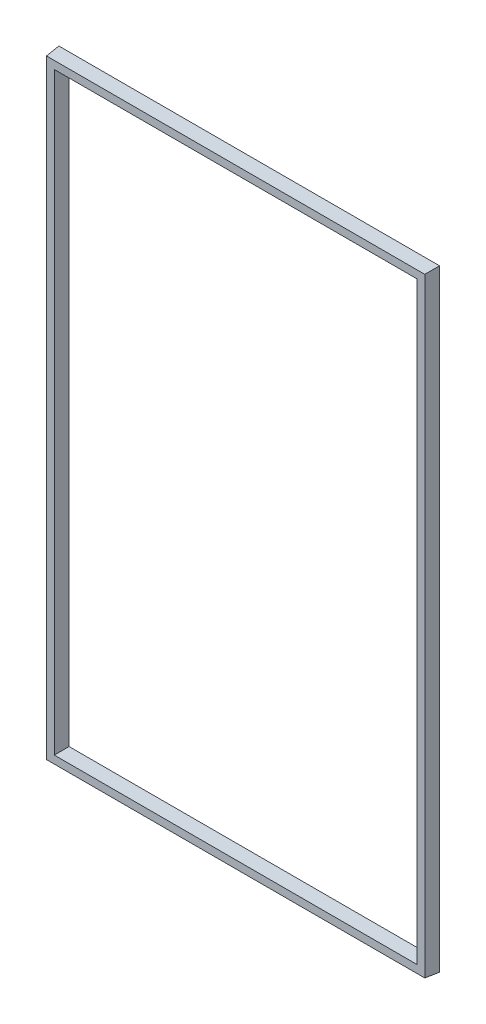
from build123d import *

# Parameters (mm, degrees)
SKETCH1_W           = 53
SKETCH1_H           = 87
BOSS_EXTRUDE1_DEPTH = 2
BOSS_EXTRUDE1_DRAFT = 5


with BuildPart() as part:
    # Sketch1 → Boss-Extrude1 (with draft: the straight prism first)
    with BuildSketch(Plane.XY):
        Polygon((-7, -97.5), (-7, -93), (-7, -12), (-7, -7.5), (-63, -7.5), (-63, -12), (-63, -93), (-63, -97.5), align=None)
        with Locations((-35, -52.5)):
            Rectangle(SKETCH1_W, SKETCH1_H, mode=Mode.SUBTRACT)
    extrude(amount=BOSS_EXTRUDE1_DEPTH)
    # Boss-Extrude1: the draft: its side faces are tilted about the plane it starts from
    boss_extrude1_sides = [part.faces().sort_by_distance(p)[0] for p in [
        (-7, -52.5, 1),
        (-35, -96, 1),
        (-8.5, -52.5, 1),
        (-35, -9, 1),
        (-61.5, -52.5, 1),
        (-63, -52.5, 1),
        (-35, -7.5, 1),
        (-35, -97.5, 1),
    ]]
    draft(boss_extrude1_sides, Plane.XY, BOSS_EXTRUDE1_DRAFT)


solid = part.part
